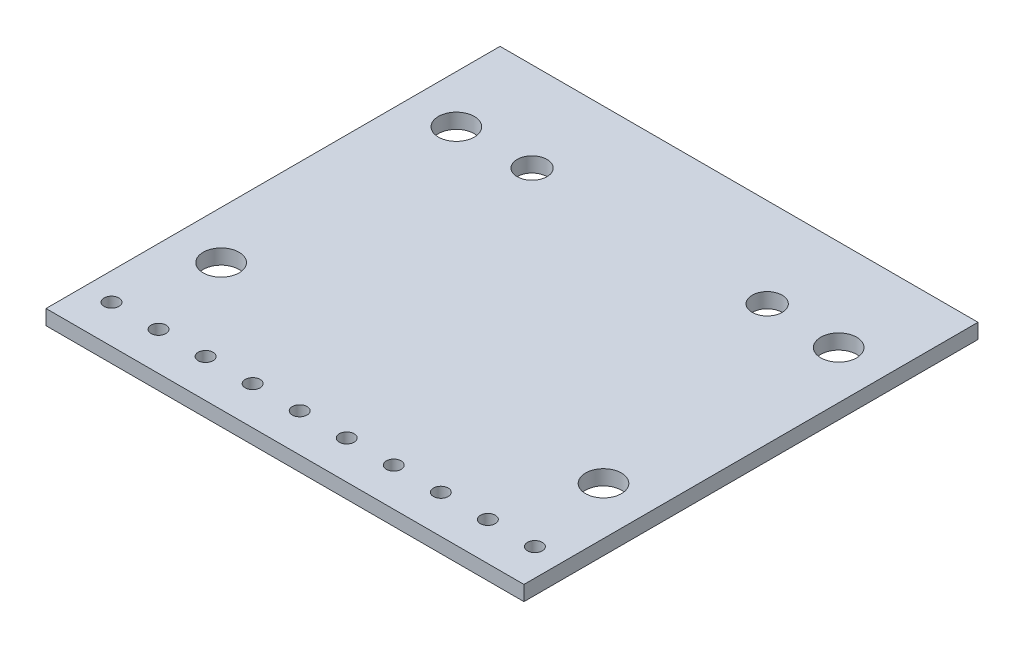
from build123d import *

# Parameters (mm, degrees)
SKETCH1_W           = 50.8
SKETCH1_H           = 48.26
SKETCH1_R           = 1.905
BOSS_EXTRUDE1_DEPTH = 1.5875
SKETCH2_R           = 0.7874
SCREWHOLES_DEPTH    = 71.087001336
SKETCH3_R           = 1.59
CUT_EXTRUDE2_DEPTH  = 71.087001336


with BuildPart() as part:
    # Sketch1 → Boss-Extrude1 (new body)
    with BuildSketch(Plane(origin=(0, 0, 0), x_dir=(1, 0, 0), z_dir=(0, 1, 0))):
        with Locations((25.4, 24.13)):
            Rectangle(SKETCH1_W, SKETCH1_H)
        with Locations(Location((5.08, 13.535, 0), (0, 0, 270))):
            Circle(SKETCH1_R, mode=Mode.SUBTRACT)
        with Locations(Location((5.08, 38.535, 0), (0, 0, 270))):
            Circle(SKETCH1_R, mode=Mode.SUBTRACT)
        with Locations(Location((45.72, 13.535, 0), (0, 0, 90))):
            Circle(SKETCH1_R, mode=Mode.SUBTRACT)
        with Locations(Location((45.72, 38.535, 0), (0, 0, 90))):
            Circle(SKETCH1_R, mode=Mode.SUBTRACT)
    extrude(amount=-BOSS_EXTRUDE1_DEPTH)

    # Sketch2 → screwHoles (cut, through all)
    with BuildSketch(Plane(origin=(0, 0, 0), x_dir=(1, 0, 0), z_dir=(0, 1, 0))):
        with Locations(Location((2.9, 4.064, 0), (0, 0, 270))):
            Circle(SKETCH2_R)
        with Locations(Location((7.9, 4.064, 0), (0, 0, 270))):
            Circle(SKETCH2_R)
        with Locations(Location((12.9, 4.064, 0), (0, 0, 270))):
            Circle(SKETCH2_R)
        with Locations(Location((17.9, 4.064, 0), (0, 0, 270))):
            Circle(SKETCH2_R)
        with Locations(Location((22.9, 4.064, 0), (0, 0, 270))):
            Circle(SKETCH2_R)
        with Locations(Location((27.9, 4.064, 0), (0, 0, 270))):
            Circle(SKETCH2_R)
        with Locations(Location((32.9, 4.064, 0), (0, 0, 270))):
            Circle(SKETCH2_R)
        with Locations(Location((37.9, 4.064, 0), (0, 0, 270))):
            Circle(SKETCH2_R)
        with Locations(Location((42.9, 4.064, 0), (0, 0, 270))):
            Circle(SKETCH2_R)
        with Locations(Location((47.9, 4.064, 0), (0, 0, 270))):
            Circle(SKETCH2_R)
    extrude(amount=-SCREWHOLES_DEPTH, mode=Mode.SUBTRACT)

    # Sketch3 → Cut-Extrude2 (cut, through all)
    with BuildSketch(Plane(origin=(0, 0, 0), x_dir=(1, 0, 0), z_dir=(0, 1, 0))):
        with Locations(Location((12.905, 38.76, 0), (0, 0, 270))):
            Circle(SKETCH3_R)
        with Locations(Location((37.895, 38.76, 0), (0, 0, 90))):
            Circle(SKETCH3_R)
    extrude(amount=-CUT_EXTRUDE2_DEPTH, mode=Mode.SUBTRACT)


solid = part.part
